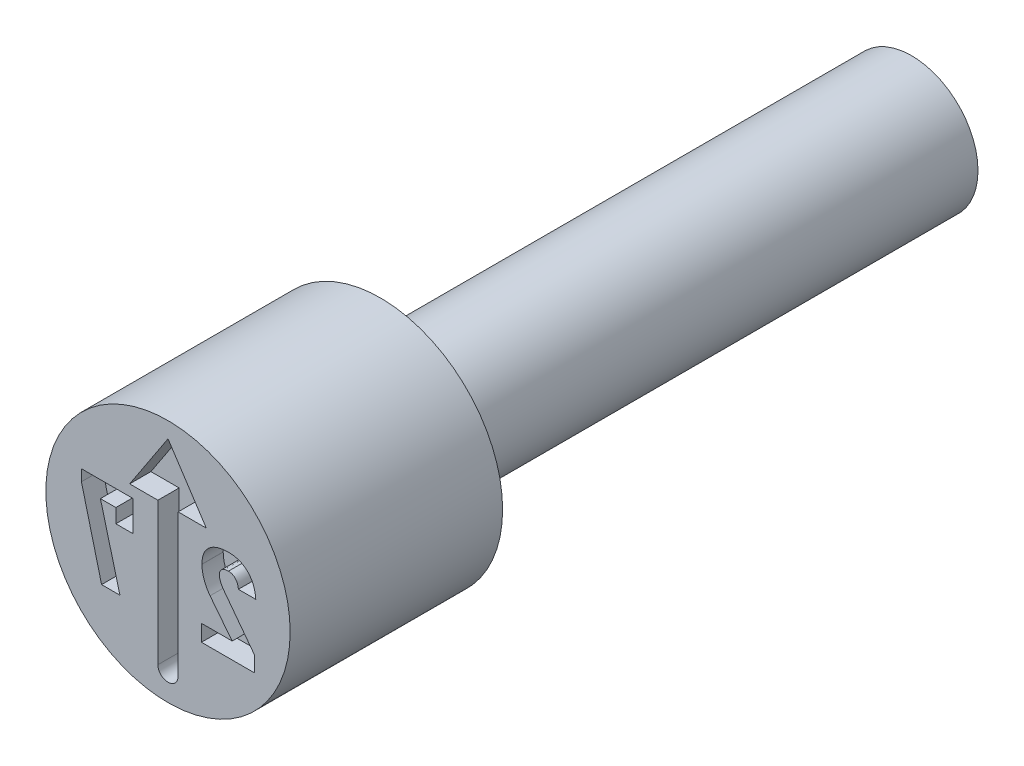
ISO-10303-21;
HEADER;
FILE_DESCRIPTION(('STEP AP214'),'2;1');
FILE_NAME('part.step','',(''),(''),'','','');
FILE_SCHEMA(('AUTOMOTIVE_DESIGN { 1 0 10303 214 1 1 1 1 }'));
ENDSEC;
DATA;
#1=APPLICATION_CONTEXT('core data for automotive mechanical design processes');
#2=APPLICATION_PROTOCOL_DEFINITION('international standard','automotive_design',2000,#1);
#3=PRODUCT_CONTEXT('',#1,'mechanical');
#4=PRODUCT('Part','Part','',(#3));
#5=PRODUCT_RELATED_PRODUCT_CATEGORY('part','',(#4));
#6=PRODUCT_DEFINITION_FORMATION('','',#4);
#7=PRODUCT_DEFINITION_CONTEXT('part definition',#1,'design');
#8=PRODUCT_DEFINITION('design','',#6,#7);
#9=PRODUCT_DEFINITION_SHAPE('','',#8);
#10=(LENGTH_UNIT() NAMED_UNIT(*) SI_UNIT(.MILLI.,.METRE.));
#11=(NAMED_UNIT(*) PLANE_ANGLE_UNIT() SI_UNIT($,.RADIAN.));
#12=(NAMED_UNIT(*) SI_UNIT($,.STERADIAN.) SOLID_ANGLE_UNIT());
#13=UNCERTAINTY_MEASURE_WITH_UNIT(LENGTH_MEASURE(1.E-05),#10,'distance_accuracy_value','');
#14=(GEOMETRIC_REPRESENTATION_CONTEXT(3) GLOBAL_UNCERTAINTY_ASSIGNED_CONTEXT((#13)) GLOBAL_UNIT_ASSIGNED_CONTEXT((#10,
#11,#12)) REPRESENTATION_CONTEXT('',''));
#15=CARTESIAN_POINT('',(0.,0.,0.));
#16=DIRECTION('',(0.,0.,1.));
#17=DIRECTION('',(1.,0.,0.));
#18=AXIS2_PLACEMENT_3D('',#15,#16,#17);
#19=CARTESIAN_POINT('',(0.,1.25,-4.));
#20=DIRECTION('',(0.,0.,1.));
#21=DIRECTION('',(1.,0.,0.));
#22=AXIS2_PLACEMENT_3D('',#19,#20,#21);
#23=PLANE('',#22);
#24=CARTESIAN_POINT('',(0.,0.,-4.));
#25=DIRECTION('',(0.,0.,1.));
#26=DIRECTION('',(1.,0.,0.));
#27=AXIS2_PLACEMENT_3D('',#24,#25,#26);
#28=CIRCLE('',#27,2.3);
#29=CARTESIAN_POINT('',(2.3,0.,-4.));
#30=VERTEX_POINT('',#29);
#31=EDGE_CURVE('E11',#30,#30,#28,.T.);
#32=ORIENTED_EDGE('',*,*,#31,.F.);
#33=EDGE_LOOP('',(#32));
#34=FACE_BOUND('',#33,.T.);
#35=CARTESIAN_POINT('',(0.,0.,-4.));
#36=DIRECTION('',(0.,0.,1.));
#37=DIRECTION('',(1.,0.,0.));
#38=AXIS2_PLACEMENT_3D('',#35,#36,#37);
#39=CIRCLE('',#38,1.25);
#40=CARTESIAN_POINT('',(1.25,0.,-4.));
#41=VERTEX_POINT('',#40);
#42=EDGE_CURVE('E430',#41,#41,#39,.T.);
#43=ORIENTED_EDGE('',*,*,#42,.T.);
#44=EDGE_LOOP('',(#43));
#45=FACE_BOUND('',#44,.T.);
#46=ADVANCED_FACE('F39',(#34,#45),#23,.F.);
#47=CARTESIAN_POINT('',(0.,0.,-0.403888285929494));
#48=DIRECTION('',(0.,0.,1.));
#49=DIRECTION('',(1.,0.,0.));
#50=AXIS2_PLACEMENT_3D('',#47,#48,#49);
#51=CYLINDRICAL_SURFACE('',#50,2.3);
#52=CARTESIAN_POINT('',(0.,0.,0.));
#53=DIRECTION('',(0.,0.,1.));
#54=DIRECTION('',(1.,0.,0.));
#55=AXIS2_PLACEMENT_3D('',#52,#53,#54);
#56=CIRCLE('',#55,2.3);
#57=CARTESIAN_POINT('',(2.3,0.,0.));
#58=VERTEX_POINT('',#57);
#59=EDGE_CURVE('E46',#58,#58,#56,.T.);
#60=ORIENTED_EDGE('',*,*,#59,.F.);
#61=EDGE_LOOP('',(#60));
#62=FACE_BOUND('',#61,.T.);
#63=ORIENTED_EDGE('',*,*,#31,.T.);
#64=EDGE_LOOP('',(#63));
#65=FACE_BOUND('',#64,.T.);
#66=ADVANCED_FACE('F415',(#62,#65),#51,.T.);
#67=CARTESIAN_POINT('',(0.,2.3,0.));
#68=DIRECTION('',(0.,0.,-1.));
#69=DIRECTION('',(-1.,0.,0.));
#70=AXIS2_PLACEMENT_3D('',#67,#68,#69);
#71=PLANE('',#70);
#72=DIRECTION('',(0.,-1.,0.));
#73=VECTOR('',#72,1.);
#74=CARTESIAN_POINT('',(-1.62996960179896,0.7,0.));
#75=LINE('',#74,#73);
#76=CARTESIAN_POINT('',(-1.62996960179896,0.7,0.));
#77=VERTEX_POINT('',#76);
#78=CARTESIAN_POINT('',(-1.62996960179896,0.486810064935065,0.));
#79=VERTEX_POINT('',#78);
#80=EDGE_CURVE('E297',#77,#79,#75,.T.);
#81=ORIENTED_EDGE('',*,*,#80,.F.);
#82=DIRECTION('',(-1.,0.,0.));
#83=VECTOR('',#82,1.);
#84=CARTESIAN_POINT('',(-0.662680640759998,0.7,0.));
#85=LINE('',#84,#83);
#86=CARTESIAN_POINT('',(-0.662680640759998,0.7,0.));
#87=VERTEX_POINT('',#86);
#88=EDGE_CURVE('E53',#87,#77,#85,.T.);
#89=ORIENTED_EDGE('',*,*,#88,.F.);
#90=DIRECTION('',(0.,1.,0.));
#91=VECTOR('',#90,1.);
#92=CARTESIAN_POINT('',(-0.662680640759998,0.125974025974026,0.));
#93=LINE('',#92,#91);
#94=CARTESIAN_POINT('',(-0.662680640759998,0.125974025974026,0.));
#95=VERTEX_POINT('',#94);
#96=EDGE_CURVE('E274',#95,#87,#93,.T.);
#97=ORIENTED_EDGE('',*,*,#96,.F.);
#98=DIRECTION('',(1.,0.,0.));
#99=VECTOR('',#98,1.);
#100=CARTESIAN_POINT('',(-0.981775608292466,0.125974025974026,0.));
#101=LINE('',#100,#99);
#102=CARTESIAN_POINT('',(-0.981775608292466,0.125974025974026,0.));
#103=VERTEX_POINT('',#102);
#104=EDGE_CURVE('E277',#103,#95,#101,.T.);
#105=ORIENTED_EDGE('',*,*,#104,.F.);
#106=DIRECTION('',(0.,-1.,0.));
#107=VECTOR('',#106,1.);
#108=CARTESIAN_POINT('',(-0.981775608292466,0.390909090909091,0.));
#109=LINE('',#108,#107);
#110=CARTESIAN_POINT('',(-0.981775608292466,0.390909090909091,0.));
#111=VERTEX_POINT('',#110);
#112=EDGE_CURVE('E311',#111,#103,#109,.T.);
#113=ORIENTED_EDGE('',*,*,#112,.F.);
#114=DIRECTION('',(1.,0.,0.));
#115=VECTOR('',#114,1.);
#116=CARTESIAN_POINT('',(-1.2725832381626,0.390909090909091,0.));
#117=LINE('',#116,#115);
#118=CARTESIAN_POINT('',(-1.2725832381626,0.390909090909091,0.));
#119=VERTEX_POINT('',#118);
#120=EDGE_CURVE('E308',#119,#111,#117,.T.);
#121=ORIENTED_EDGE('',*,*,#120,.F.);
#122=DIRECTION('',(-0.255602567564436,0.966781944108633,0.));
#123=VECTOR('',#122,1.);
#124=CARTESIAN_POINT('',(-0.904847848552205,-1.,0.));
#125=LINE('',#124,#123);
#126=CARTESIAN_POINT('',(-0.904847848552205,-1.,0.));
#127=VERTEX_POINT('',#126);
#128=EDGE_CURVE('E305',#127,#119,#125,.T.);
#129=ORIENTED_EDGE('',*,*,#128,.F.);
#130=DIRECTION('',(1.,0.,0.));
#131=VECTOR('',#130,1.);
#132=CARTESIAN_POINT('',(-1.25050531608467,-1.,0.));
#133=LINE('',#132,#131);
#134=CARTESIAN_POINT('',(-1.25050531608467,-1.,0.));
#135=VERTEX_POINT('',#134);
#136=EDGE_CURVE('E302',#135,#127,#133,.T.);
#137=ORIENTED_EDGE('',*,*,#136,.F.);
#138=DIRECTION('',(0.247293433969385,-0.968940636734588,0.));
#139=VECTOR('',#138,1.);
#140=CARTESIAN_POINT('',(-1.62996960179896,0.486810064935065,0.));
#141=LINE('',#140,#139);
#142=EDGE_CURVE('E299',#79,#135,#141,.T.);
#143=ORIENTED_EDGE('',*,*,#142,.F.);
#144=EDGE_LOOP('',(#81,#89,#97,#105,#113,#121,#129,#137,#143));
#145=FACE_BOUND('',#144,.T.);
#146=DIRECTION('',(0.,1.,0.));
#147=VECTOR('',#146,1.);
#148=CARTESIAN_POINT('',(1.63114646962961,-1.,0.));
#149=LINE('',#148,#147);
#150=CARTESIAN_POINT('',(1.63114646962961,-1.,0.));
#151=VERTEX_POINT('',#150);
#152=CARTESIAN_POINT('',(1.63114646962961,-0.710917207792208,0.));
#153=VERTEX_POINT('',#152);
#154=EDGE_CURVE('E602',#151,#153,#149,.T.);
#155=ORIENTED_EDGE('',*,*,#154,.F.);
#156=DIRECTION('',(1.,0.,0.));
#157=VECTOR('',#156,1.);
#158=CARTESIAN_POINT('',(0.630050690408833,-1.,0.));
#159=LINE('',#158,#157);
#160=CARTESIAN_POINT('',(0.630050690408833,-1.,0.));
#161=VERTEX_POINT('',#160);
#162=EDGE_CURVE('E61',#161,#151,#159,.T.);
#163=ORIENTED_EDGE('',*,*,#162,.F.);
#164=DIRECTION('',(0.,-1.,0.));
#165=VECTOR('',#164,1.);
#166=CARTESIAN_POINT('',(0.630050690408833,-0.690909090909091,0.));
#167=LINE('',#166,#165);
#168=CARTESIAN_POINT('',(0.630050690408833,-0.690909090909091,0.));
#169=VERTEX_POINT('',#168);
#170=EDGE_CURVE('E335',#169,#161,#167,.T.);
#171=ORIENTED_EDGE('',*,*,#170,.F.);
#172=DIRECTION('',(-1.,0.,0.));
#173=VECTOR('',#172,1.);
#174=CARTESIAN_POINT('',(1.20856124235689,-0.690909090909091,0.));
#175=LINE('',#174,#173);
#176=CARTESIAN_POINT('',(1.20856124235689,-0.690909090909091,0.));
#177=VERTEX_POINT('',#176);
#178=EDGE_CURVE('E530',#177,#169,#175,.T.);
#179=ORIENTED_EDGE('',*,*,#178,.F.);
#180=DIRECTION('',(0.618183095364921,-0.786034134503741,0.));
#181=VECTOR('',#180,1.);
#182=CARTESIAN_POINT('',(0.791840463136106,-0.161038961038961,0.));
#183=LINE('',#182,#181);
#184=CARTESIAN_POINT('',(0.791840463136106,-0.161038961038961,0.));
#185=VERTEX_POINT('',#184);
#186=EDGE_CURVE('E533',#185,#177,#183,.T.);
#187=ORIENTED_EDGE('',*,*,#186,.F.);
#188=CARTESIAN_POINT('',(0.639364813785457,0.27637987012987,0.));
#189=CARTESIAN_POINT('',(0.639804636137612,0.257037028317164,0.));
#190=CARTESIAN_POINT('',(0.640685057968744,0.218317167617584,0.));
#191=CARTESIAN_POINT('',(0.648632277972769,0.160367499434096,0.));
#192=CARTESIAN_POINT('',(0.661439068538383,0.102713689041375,0.));
#193=CARTESIAN_POINT('',(0.679027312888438,0.0456342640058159,0.));
#194=CARTESIAN_POINT('',(0.700876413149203,-0.00988207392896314,0.));
#195=CARTESIAN_POINT('',(0.727099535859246,-0.0630750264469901,0.));
#196=CARTESIAN_POINT('',(0.756695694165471,-0.113968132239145,0.));
#197=CARTESIAN_POINT('',(0.780147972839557,-0.145378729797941,0.));
#198=CARTESIAN_POINT('',(0.791840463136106,-0.161038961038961,0.));
#199=B_SPLINE_CURVE_WITH_KNOTS('',3,(#188,#189,#190,#191,#192,#193,#194,#195,#196,#197,#198),
.UNSPECIFIED.,.F.,.F.,(4,1,1,1,1,1,1,1,4),(0.,0.123046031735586,0.246309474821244,
0.371480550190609,0.498560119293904,0.626024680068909,0.750715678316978,0.875715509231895,1.),.UNSPECIFIED.);
#200=CARTESIAN_POINT('',(0.639364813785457,0.27637987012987,0.));
#201=VERTEX_POINT('',#200);
#202=EDGE_CURVE('E536',#201,#185,#199,.T.);
#203=ORIENTED_EDGE('',*,*,#202,.F.);
#204=DIRECTION('',(0.,-1.,0.));
#205=VECTOR('',#204,1.);
#206=CARTESIAN_POINT('',(0.639364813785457,0.27775974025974,0.));
#207=LINE('',#206,#205);
#208=CARTESIAN_POINT('',(0.639364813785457,0.27775974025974,0.));
#209=VERTEX_POINT('',#208);
#210=EDGE_CURVE('E541',#209,#201,#207,.T.);
#211=ORIENTED_EDGE('',*,*,#210,.F.);
#212=CARTESIAN_POINT('',(1.13991270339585,0.722077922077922,0.));
#213=CARTESIAN_POINT('',(1.12057893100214,0.721803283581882,0.));
#214=CARTESIAN_POINT('',(1.08297730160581,0.721269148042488,0.));
#215=CARTESIAN_POINT('',(1.02823583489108,0.715503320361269,0.));
#216=CARTESIAN_POINT('',(0.976729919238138,0.706801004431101,0.));
#217=CARTESIAN_POINT('',(0.928542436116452,0.694069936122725,0.));
#218=CARTESIAN_POINT('',(0.883866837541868,0.677463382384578,0.));
#219=CARTESIAN_POINT('',(0.842569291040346,0.657439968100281,0.));
#220=CARTESIAN_POINT('',(0.804563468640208,0.633829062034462,0.));
#221=CARTESIAN_POINT('',(0.770140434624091,0.606580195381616,0.));
#222=CARTESIAN_POINT('',(0.739168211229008,0.57618842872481,0.));
#223=CARTESIAN_POINT('',(0.712509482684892,0.542345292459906,0.));
#224=CARTESIAN_POINT('',(0.68943193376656,0.505734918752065,0.));
#225=CARTESIAN_POINT('',(0.671392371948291,0.465647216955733,0.));
#226=CARTESIAN_POINT('',(0.656540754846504,0.423024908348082,0.));
#227=CARTESIAN_POINT('',(0.646924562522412,0.377103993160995,0.));
#228=CARTESIAN_POINT('',(0.640444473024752,0.328425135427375,0.));
#229=CARTESIAN_POINT('',(0.639730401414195,0.294915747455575,0.));
#230=CARTESIAN_POINT('',(0.639364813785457,0.27775974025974,0.));
#231=B_SPLINE_CURVE_WITH_KNOTS('',3,(#212,#213,#214,#215,#216,#217,#218,#219,#220,#221,#222,
#223,#224,#225,#226,#227,#228,#229,#230),.UNSPECIFIED.,.F.,.F.,(4,1,1,1,1,1,1,1,1,1,1,1,1,1,1,1,
4),(0.,0.0762312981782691,0.148259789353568,0.216860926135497,0.28210063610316,
0.344528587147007,0.404571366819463,0.462840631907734,0.520642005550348,0.577409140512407,
0.633580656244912,0.690215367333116,0.747647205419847,0.806597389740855,0.867894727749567,
0.932365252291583,1.),.UNSPECIFIED.);
#232=CARTESIAN_POINT('',(1.13991270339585,0.722077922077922,0.));
#233=VERTEX_POINT('',#232);
#234=EDGE_CURVE('E547',#233,#209,#231,.T.);
#235=ORIENTED_EDGE('',*,*,#234,.F.);
#236=CARTESIAN_POINT('',(1.65218948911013,0.211870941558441,0.));
#237=CARTESIAN_POINT('',(1.65057580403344,0.231576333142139,0.));
#238=CARTESIAN_POINT('',(1.64742592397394,0.270040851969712,0.));
#239=CARTESIAN_POINT('',(1.63709924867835,0.32568153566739,0.));
#240=CARTESIAN_POINT('',(1.62375242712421,0.378091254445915,0.));
#241=CARTESIAN_POINT('',(1.60677347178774,0.427259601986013,0.));
#242=CARTESIAN_POINT('',(1.58495545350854,0.472617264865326,0.));
#243=CARTESIAN_POINT('',(1.56044224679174,0.5151124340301,0.));
#244=CARTESIAN_POINT('',(1.53095900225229,0.553430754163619,0.));
#245=CARTESIAN_POINT('',(1.49868545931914,0.588854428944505,0.));
#246=CARTESIAN_POINT('',(1.46273850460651,0.62005508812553,0.));
#247=CARTESIAN_POINT('',(1.42440917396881,0.647578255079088,0.));
#248=CARTESIAN_POINT('',(1.38311786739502,0.670481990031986,0.));
#249=CARTESIAN_POINT('',(1.33949232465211,0.68948199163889,0.));
#250=CARTESIAN_POINT('',(1.29304886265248,0.703902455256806,0.));
#251=CARTESIAN_POINT('',(1.24439414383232,0.714704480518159,0.));
#252=CARTESIAN_POINT('',(1.1929697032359,0.720934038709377,0.));
#253=CARTESIAN_POINT('',(1.15786767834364,0.721690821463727,0.));
#254=CARTESIAN_POINT('',(1.13991270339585,0.722077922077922,0.));
#255=B_SPLINE_CURVE_WITH_KNOTS('',3,(#236,#237,#238,#239,#240,#241,#242,#243,#244,#245,#246,
#247,#248,#249,#250,#251,#252,#253,#254),.UNSPECIFIED.,.F.,.F.,(4,1,1,1,1,1,1,1,1,1,1,1,1,1,1,1,
4),(0.,0.0733268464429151,0.14313249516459,0.209679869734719,0.273918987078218,0.33576228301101,
0.396210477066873,0.45560885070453,0.514796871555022,0.573764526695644,0.631900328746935,
0.689592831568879,0.748648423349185,0.808163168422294,0.86976604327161,0.933384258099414,1.),.UNSPECIFIED.);
#256=CARTESIAN_POINT('',(1.65218948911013,0.211870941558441,0.));
#257=VERTEX_POINT('',#256);
#258=EDGE_CURVE('E552',#257,#233,#255,.T.);
#259=ORIENTED_EDGE('',*,*,#258,.F.);
#260=DIRECTION('',(0.,1.,0.));
#261=VECTOR('',#260,1.);
#262=CARTESIAN_POINT('',(1.65218948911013,0.210836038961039,0.));
#263=LINE('',#262,#261);
#264=CARTESIAN_POINT('',(1.65218948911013,0.210836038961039,0.));
#265=VERTEX_POINT('',#264);
#266=EDGE_CURVE('E560',#265,#257,#263,.T.);
#267=ORIENTED_EDGE('',*,*,#266,.F.);
#268=DIRECTION('',(1.,0.,0.));
#269=VECTOR('',#268,1.);
#270=CARTESIAN_POINT('',(1.32516026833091,0.210836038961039,0.));
#271=LINE('',#270,#269);
#272=CARTESIAN_POINT('',(1.32516026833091,0.210836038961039,0.));
#273=VERTEX_POINT('',#272);
#274=EDGE_CURVE('E566',#273,#265,#271,.T.);
#275=ORIENTED_EDGE('',*,*,#274,.F.);
#276=DIRECTION('',(0.,-1.,0.));
#277=VECTOR('',#276,1.);
#278=CARTESIAN_POINT('',(1.32516026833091,0.211870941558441,0.));
#279=LINE('',#278,#277);
#280=CARTESIAN_POINT('',(1.32516026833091,0.211870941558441,0.));
#281=VERTEX_POINT('',#280);
#282=EDGE_CURVE('E569',#281,#273,#279,.T.);
#283=ORIENTED_EDGE('',*,*,#282,.F.);
#284=CARTESIAN_POINT('',(1.13749793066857,0.412987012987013,0.));
#285=CARTESIAN_POINT('',(1.14999542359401,0.412499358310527,0.));
#286=CARTESIAN_POINT('',(1.1742784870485,0.411551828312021,0.));
#287=CARTESIAN_POINT('',(1.20865530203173,0.401050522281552,0.));
#288=CARTESIAN_POINT('',(1.23963216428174,0.384578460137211,0.));
#289=CARTESIAN_POINT('',(1.26633668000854,0.361074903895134,0.));
#290=CARTESIAN_POINT('',(1.2884500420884,0.331565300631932,0.));
#291=CARTESIAN_POINT('',(1.30639717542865,0.296815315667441,0.));
#292=CARTESIAN_POINT('',(1.31858673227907,0.256197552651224,0.));
#293=CARTESIAN_POINT('',(1.32289858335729,0.227121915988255,0.));
#294=CARTESIAN_POINT('',(1.32516026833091,0.211870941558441,0.));
#295=B_SPLINE_CURVE_WITH_KNOTS('',3,(#284,#285,#286,#287,#288,#289,#290,#291,#292,#293,#294),
.UNSPECIFIED.,.F.,.F.,(4,1,1,1,1,1,1,1,4),(0.,0.122603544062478,0.238222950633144,
0.350089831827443,0.46555970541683,0.58502806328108,0.711014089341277,0.848418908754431,1.),.UNSPECIFIED.);
#296=CARTESIAN_POINT('',(1.13749793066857,0.412987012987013,0.));
#297=VERTEX_POINT('',#296);
#298=EDGE_CURVE('E572',#297,#281,#295,.T.);
#299=ORIENTED_EDGE('',*,*,#298,.F.);
#300=CARTESIAN_POINT('',(0.967773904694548,0.268790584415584,0.));
#301=CARTESIAN_POINT('',(0.968245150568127,0.279660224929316,0.));
#302=CARTESIAN_POINT('',(0.96914798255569,0.30048472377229,0.));
#303=CARTESIAN_POINT('',(0.977654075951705,0.329826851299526,0.));
#304=CARTESIAN_POINT('',(0.991595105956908,0.355379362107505,0.));
#305=CARTESIAN_POINT('',(1.01156202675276,0.37648565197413,0.));
#306=CARTESIAN_POINT('',(1.03641931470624,0.393179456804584,0.));
#307=CARTESIAN_POINT('',(1.06616174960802,0.404944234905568,0.));
#308=CARTESIAN_POINT('',(1.10040017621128,0.411690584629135,0.));
#309=CARTESIAN_POINT('',(1.12470248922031,0.412539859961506,0.));
#310=CARTESIAN_POINT('',(1.13749793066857,0.412987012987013,0.));
#311=B_SPLINE_CURVE_WITH_KNOTS('',3,(#300,#301,#302,#303,#304,#305,#306,#307,#308,#309,#310),
.UNSPECIFIED.,.F.,.F.,(4,1,1,1,1,1,1,1,4),(0.,0.128749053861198,0.246662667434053,
0.359069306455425,0.471077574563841,0.588039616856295,0.711712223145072,0.848213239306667,1.),.UNSPECIFIED.);
#312=CARTESIAN_POINT('',(0.967773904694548,0.268790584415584,0.));
#313=VERTEX_POINT('',#312);
#314=EDGE_CURVE('E577',#313,#297,#311,.T.);
#315=ORIENTED_EDGE('',*,*,#314,.F.);
#316=DIRECTION('',(0.,1.,0.));
#317=VECTOR('',#316,1.);
#318=CARTESIAN_POINT('',(0.967773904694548,0.266375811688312,0.));
#319=LINE('',#318,#317);
#320=CARTESIAN_POINT('',(0.967773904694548,0.266375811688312,0.));
#321=VERTEX_POINT('',#320);
#322=EDGE_CURVE('E585',#321,#313,#319,.T.);
#323=ORIENTED_EDGE('',*,*,#322,.F.);
#324=CARTESIAN_POINT('',(1.05022114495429,0.058705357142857,0.));
#325=CARTESIAN_POINT('',(1.0380535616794,0.0758501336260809,0.));
#326=CARTESIAN_POINT('',(1.01434539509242,0.10925621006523,0.));
#327=CARTESIAN_POINT('',(0.992887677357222,0.155132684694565,0.));
#328=CARTESIAN_POINT('',(0.97952040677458,0.191100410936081,0.));
#329=CARTESIAN_POINT('',(0.9731498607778,0.217184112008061,0.));
#330=CARTESIAN_POINT('',(0.968605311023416,0.242070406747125,0.));
#331=CARTESIAN_POINT('',(0.968045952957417,0.258422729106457,0.));
#332=CARTESIAN_POINT('',(0.967773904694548,0.266375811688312,0.));
#333=B_SPLINE_CURVE_WITH_KNOTS('',3,(#324,#325,#326,#327,#328,#329,#330,#331,#332),
.UNSPECIFIED.,.F.,.F.,(4,1,1,1,1,1,4),(0.,0.277375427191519,0.54045759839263,0.666416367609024,
0.784009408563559,0.894951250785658,1.),.UNSPECIFIED.);
#334=CARTESIAN_POINT('',(1.05022114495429,0.058705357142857,0.));
#335=VERTEX_POINT('',#334);
#336=EDGE_CURVE('E591',#335,#321,#333,.T.);
#337=ORIENTED_EDGE('',*,*,#336,.F.);
#338=DIRECTION('',(-0.602458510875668,0.798150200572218,0.));
#339=VECTOR('',#338,1.);
#340=CARTESIAN_POINT('',(1.63114646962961,-0.710917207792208,0.));
#341=LINE('',#340,#339);
#342=EDGE_CURVE('E596',#153,#335,#341,.T.);
#343=ORIENTED_EDGE('',*,*,#342,.F.);
#344=EDGE_LOOP('',(#155,#163,#171,#179,#187,#203,#211,#235,#259,#267,#275,#283,#299,#315,#323,
#337,#343));
#345=FACE_BOUND('',#344,.T.);
#346=DIRECTION('',(0.,1.,0.));
#347=VECTOR('',#346,1.);
#348=CARTESIAN_POINT('',(0.190473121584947,0.906351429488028,0.));
#349=LINE('',#348,#347);
#350=CARTESIAN_POINT('',(0.190473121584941,-1.77616183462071,0.));
#351=VERTEX_POINT('',#350);
#352=CARTESIAN_POINT('',(0.190473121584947,0.906351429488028,0.));
#353=VERTEX_POINT('',#352);
#354=EDGE_CURVE('E469',#351,#353,#349,.T.);
#355=ORIENTED_EDGE('',*,*,#354,.F.);
#356=CARTESIAN_POINT('',(1.6342449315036E-13,-1.77616183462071,0.));
#357=DIRECTION('',(0.,0.,1.));
#358=DIRECTION('',(1.,0.,0.));
#359=AXIS2_PLACEMENT_3D('',#356,#357,#358);
#360=CIRCLE('',#359,0.190473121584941);
#361=CARTESIAN_POINT('',(-0.190473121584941,-1.77616183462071,0.));
#362=VERTEX_POINT('',#361);
#363=EDGE_CURVE('E472',#362,#351,#360,.T.);
#364=ORIENTED_EDGE('',*,*,#363,.F.);
#365=DIRECTION('',(0.,-1.,0.));
#366=VECTOR('',#365,1.);
#367=CARTESIAN_POINT('',(-0.190473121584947,0.906351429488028,0.));
#368=LINE('',#367,#366);
#369=CARTESIAN_POINT('',(-0.190473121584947,0.906351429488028,0.));
#370=VERTEX_POINT('',#369);
#371=EDGE_CURVE('E453',#370,#362,#368,.T.);
#372=ORIENTED_EDGE('',*,*,#371,.F.);
#373=DIRECTION('',(1.,0.,0.));
#374=VECTOR('',#373,1.);
#375=CARTESIAN_POINT('',(-0.721917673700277,0.906351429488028,0.));
#376=LINE('',#375,#374);
#377=CARTESIAN_POINT('',(-0.721917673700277,0.906351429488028,0.));
#378=VERTEX_POINT('',#377);
#379=EDGE_CURVE('E457',#378,#370,#376,.T.);
#380=ORIENTED_EDGE('',*,*,#379,.F.);
#381=DIRECTION('',(-0.550159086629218,-0.835059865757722,0.));
#382=VECTOR('',#381,1.);
#383=CARTESIAN_POINT('',(0.,2.00211534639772,0.));
#384=LINE('',#383,#382);
#385=CARTESIAN_POINT('',(0.,2.00211534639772,0.));
#386=VERTEX_POINT('',#385);
#387=EDGE_CURVE('E460',#386,#378,#384,.T.);
#388=ORIENTED_EDGE('',*,*,#387,.F.);
#389=DIRECTION('',(-0.550159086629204,0.835059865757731,0.));
#390=VECTOR('',#389,1.);
#391=CARTESIAN_POINT('',(0.,2.00211534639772,0.));
#392=LINE('',#391,#390);
#393=CARTESIAN_POINT('',(0.721917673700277,0.906351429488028,0.));
#394=VERTEX_POINT('',#393);
#395=EDGE_CURVE('E463',#394,#386,#392,.T.);
#396=ORIENTED_EDGE('',*,*,#395,.F.);
#397=DIRECTION('',(1.,0.,0.));
#398=VECTOR('',#397,1.);
#399=CARTESIAN_POINT('',(0.721917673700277,0.906351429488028,0.));
#400=LINE('',#399,#398);
#401=EDGE_CURVE('E466',#353,#394,#400,.T.);
#402=ORIENTED_EDGE('',*,*,#401,.F.);
#403=EDGE_LOOP('',(#355,#364,#372,#380,#388,#396,#402));
#404=FACE_BOUND('',#403,.T.);
#405=ORIENTED_EDGE('',*,*,#59,.T.);
#406=EDGE_LOOP('',(#405));
#407=FACE_BOUND('',#406,.T.);
#408=ADVANCED_FACE('F412',(#145,#345,#404,#407),#71,.F.);
#409=CARTESIAN_POINT('',(0.,0.,-14.));
#410=DIRECTION('',(0.,0.,1.));
#411=DIRECTION('',(1.,0.,0.));
#412=AXIS2_PLACEMENT_3D('',#409,#410,#411);
#413=PLANE('',#412);
#414=CARTESIAN_POINT('',(0.,0.,-14.));
#415=DIRECTION('',(0.,0.,1.));
#416=DIRECTION('',(1.,0.,0.));
#417=AXIS2_PLACEMENT_3D('',#414,#415,#416);
#418=CIRCLE('',#417,1.25);
#419=CARTESIAN_POINT('',(1.25,0.,-14.));
#420=VERTEX_POINT('',#419);
#421=EDGE_CURVE('E431',#420,#420,#418,.T.);
#422=ORIENTED_EDGE('',*,*,#421,.F.);
#423=EDGE_LOOP('',(#422));
#424=FACE_BOUND('',#423,.T.);
#425=ADVANCED_FACE('F408',(#424),#413,.F.);
#426=CARTESIAN_POINT('',(0.,0.,-0.403888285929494));
#427=DIRECTION('',(0.,0.,1.));
#428=DIRECTION('',(1.,0.,0.));
#429=AXIS2_PLACEMENT_3D('',#426,#427,#428);
#430=CYLINDRICAL_SURFACE('',#429,1.25);
#431=ORIENTED_EDGE('',*,*,#42,.F.);
#432=EDGE_LOOP('',(#431));
#433=FACE_BOUND('',#432,.T.);
#434=ORIENTED_EDGE('',*,*,#421,.T.);
#435=EDGE_LOOP('',(#434));
#436=FACE_BOUND('',#435,.T.);
#437=ADVANCED_FACE('F404',(#433,#436),#430,.T.);
#438=CARTESIAN_POINT('',(1.6342449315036E-13,-1.77616183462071,-0.4));
#439=DIRECTION('',(0.,0.,1.));
#440=DIRECTION('',(1.,0.,0.));
#441=AXIS2_PLACEMENT_3D('',#438,#439,#440);
#442=CYLINDRICAL_SURFACE('',#441,0.190473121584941);
#443=ORIENTED_EDGE('',*,*,#363,.T.);
#444=DIRECTION('',(0.,0.,1.));
#445=VECTOR('',#444,1.);
#446=CARTESIAN_POINT('',(0.190473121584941,-1.77616183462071,-0.4));
#447=LINE('',#446,#445);
#448=CARTESIAN_POINT('',(0.190473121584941,-1.77616183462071,-0.4));
#449=VERTEX_POINT('',#448);
#450=EDGE_CURVE('E439',#449,#351,#447,.T.);
#451=ORIENTED_EDGE('',*,*,#450,.F.);
#452=CARTESIAN_POINT('',(1.6342449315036E-13,-1.77616183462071,-0.4));
#453=DIRECTION('',(0.,0.,1.));
#454=DIRECTION('',(1.,0.,0.));
#455=AXIS2_PLACEMENT_3D('',#452,#453,#454);
#456=CIRCLE('',#455,0.190473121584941);
#457=CARTESIAN_POINT('',(-0.190473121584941,-1.77616183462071,-0.4));
#458=VERTEX_POINT('',#457);
#459=EDGE_CURVE('E456',#458,#449,#456,.T.);
#460=ORIENTED_EDGE('',*,*,#459,.F.);
#461=DIRECTION('',(0.,0.,1.));
#462=VECTOR('',#461,1.);
#463=CARTESIAN_POINT('',(-0.190473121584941,-1.77616183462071,-0.4));
#464=LINE('',#463,#462);
#465=EDGE_CURVE('E432',#458,#362,#464,.T.);
#466=ORIENTED_EDGE('',*,*,#465,.T.);
#467=EDGE_LOOP('',(#443,#451,#460,#466));
#468=FACE_BOUND('',#467,.T.);
#469=ADVANCED_FACE('F382',(#468),#442,.F.);
#470=CARTESIAN_POINT('',(-0.190473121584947,0.906351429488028,-0.4));
#471=DIRECTION('',(-1.,0.,0.));
#472=DIRECTION('',(0.,-1.,0.));
#473=AXIS2_PLACEMENT_3D('',#470,#471,#472);
#474=PLANE('',#473);
#475=ORIENTED_EDGE('',*,*,#371,.T.);
#476=ORIENTED_EDGE('',*,*,#465,.F.);
#477=DIRECTION('',(0.,-1.,0.));
#478=VECTOR('',#477,1.);
#479=CARTESIAN_POINT('',(-0.190473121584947,0.906351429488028,-0.4));
#480=LINE('',#479,#478);
#481=CARTESIAN_POINT('',(-0.190473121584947,0.906351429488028,-0.4));
#482=VERTEX_POINT('',#481);
#483=EDGE_CURVE('E444',#482,#458,#480,.T.);
#484=ORIENTED_EDGE('',*,*,#483,.F.);
#485=DIRECTION('',(0.,0.,1.));
#486=VECTOR('',#485,1.);
#487=CARTESIAN_POINT('',(-0.190473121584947,0.906351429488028,-0.4));
#488=LINE('',#487,#486);
#489=EDGE_CURVE('E436',#482,#370,#488,.T.);
#490=ORIENTED_EDGE('',*,*,#489,.T.);
#491=EDGE_LOOP('',(#475,#476,#484,#490));
#492=FACE_BOUND('',#491,.T.);
#493=ADVANCED_FACE('F378',(#492),#474,.F.);
#494=CARTESIAN_POINT('',(-0.721917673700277,0.906351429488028,-0.4));
#495=DIRECTION('',(0.,-1.,0.));
#496=DIRECTION('',(0.,0.,-1.));
#497=AXIS2_PLACEMENT_3D('',#494,#495,#496);
#498=PLANE('',#497);
#499=ORIENTED_EDGE('',*,*,#379,.T.);
#500=ORIENTED_EDGE('',*,*,#489,.F.);
#501=DIRECTION('',(1.,0.,0.));
#502=VECTOR('',#501,1.);
#503=CARTESIAN_POINT('',(-0.721917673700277,0.906351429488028,-0.4));
#504=LINE('',#503,#502);
#505=CARTESIAN_POINT('',(-0.721917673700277,0.906351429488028,-0.4));
#506=VERTEX_POINT('',#505);
#507=EDGE_CURVE('E477',#506,#482,#504,.T.);
#508=ORIENTED_EDGE('',*,*,#507,.F.);
#509=DIRECTION('',(0.,0.,1.));
#510=VECTOR('',#509,1.);
#511=CARTESIAN_POINT('',(-0.721917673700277,0.906351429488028,-0.4));
#512=LINE('',#511,#510);
#513=EDGE_CURVE('E450',#506,#378,#512,.T.);
#514=ORIENTED_EDGE('',*,*,#513,.T.);
#515=EDGE_LOOP('',(#499,#500,#508,#514));
#516=FACE_BOUND('',#515,.T.);
#517=ADVANCED_FACE('F381',(#516),#498,.F.);
#518=CARTESIAN_POINT('',(0.,2.00211534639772,-0.4));
#519=DIRECTION('',(-0.835059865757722,0.550159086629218,0.));
#520=DIRECTION('',(-0.550159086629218,-0.835059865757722,0.));
#521=AXIS2_PLACEMENT_3D('',#518,#519,#520);
#522=PLANE('',#521);
#523=ORIENTED_EDGE('',*,*,#387,.T.);
#524=ORIENTED_EDGE('',*,*,#513,.F.);
#525=DIRECTION('',(-0.550159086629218,-0.835059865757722,0.));
#526=VECTOR('',#525,1.);
#527=CARTESIAN_POINT('',(0.,2.00211534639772,-0.4));
#528=LINE('',#527,#526);
#529=CARTESIAN_POINT('',(0.,2.00211534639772,-0.4));
#530=VERTEX_POINT('',#529);
#531=EDGE_CURVE('E480',#530,#506,#528,.T.);
#532=ORIENTED_EDGE('',*,*,#531,.F.);
#533=DIRECTION('',(0.,0.,1.));
#534=VECTOR('',#533,1.);
#535=CARTESIAN_POINT('',(0.,2.00211534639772,-0.4));
#536=LINE('',#535,#534);
#537=EDGE_CURVE('E448',#530,#386,#536,.T.);
#538=ORIENTED_EDGE('',*,*,#537,.T.);
#539=EDGE_LOOP('',(#523,#524,#532,#538));
#540=FACE_BOUND('',#539,.T.);
#541=ADVANCED_FACE('F386',(#540),#522,.F.);
#542=CARTESIAN_POINT('',(0.,2.00211534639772,-0.4));
#543=DIRECTION('',(0.835059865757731,0.550159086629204,0.));
#544=DIRECTION('',(-0.550159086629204,0.835059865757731,0.));
#545=AXIS2_PLACEMENT_3D('',#542,#543,#544);
#546=PLANE('',#545);
#547=ORIENTED_EDGE('',*,*,#395,.T.);
#548=ORIENTED_EDGE('',*,*,#537,.F.);
#549=DIRECTION('',(-0.550159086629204,0.835059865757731,0.));
#550=VECTOR('',#549,1.);
#551=CARTESIAN_POINT('',(0.,2.00211534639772,-0.4));
#552=LINE('',#551,#550);
#553=CARTESIAN_POINT('',(0.721917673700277,0.906351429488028,-0.4));
#554=VERTEX_POINT('',#553);
#555=EDGE_CURVE('E483',#554,#530,#552,.T.);
#556=ORIENTED_EDGE('',*,*,#555,.F.);
#557=DIRECTION('',(0.,0.,1.));
#558=VECTOR('',#557,1.);
#559=CARTESIAN_POINT('',(0.721917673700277,0.906351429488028,-0.4));
#560=LINE('',#559,#558);
#561=EDGE_CURVE('E446',#554,#394,#560,.T.);
#562=ORIENTED_EDGE('',*,*,#561,.T.);
#563=EDGE_LOOP('',(#547,#548,#556,#562));
#564=FACE_BOUND('',#563,.T.);
#565=ADVANCED_FACE('F390',(#564),#546,.F.);
#566=CARTESIAN_POINT('',(0.721917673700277,0.906351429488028,-0.4));
#567=DIRECTION('',(0.,-1.,0.));
#568=DIRECTION('',(0.,0.,-1.));
#569=AXIS2_PLACEMENT_3D('',#566,#567,#568);
#570=PLANE('',#569);
#571=ORIENTED_EDGE('',*,*,#401,.T.);
#572=ORIENTED_EDGE('',*,*,#561,.F.);
#573=DIRECTION('',(1.,0.,0.));
#574=VECTOR('',#573,1.);
#575=CARTESIAN_POINT('',(0.721917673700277,0.906351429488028,-0.4));
#576=LINE('',#575,#574);
#577=CARTESIAN_POINT('',(0.190473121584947,0.906351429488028,-0.4));
#578=VERTEX_POINT('',#577);
#579=EDGE_CURVE('E486',#578,#554,#576,.T.);
#580=ORIENTED_EDGE('',*,*,#579,.F.);
#581=DIRECTION('',(0.,0.,1.));
#582=VECTOR('',#581,1.);
#583=CARTESIAN_POINT('',(0.190473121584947,0.906351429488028,-0.4));
#584=LINE('',#583,#582);
#585=EDGE_CURVE('E443',#578,#353,#584,.T.);
#586=ORIENTED_EDGE('',*,*,#585,.T.);
#587=EDGE_LOOP('',(#571,#572,#580,#586));
#588=FACE_BOUND('',#587,.T.);
#589=ADVANCED_FACE('F394',(#588),#570,.F.);
#590=CARTESIAN_POINT('',(0.190473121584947,0.906351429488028,-0.4));
#591=DIRECTION('',(1.,0.,0.));
#592=DIRECTION('',(0.,1.,0.));
#593=AXIS2_PLACEMENT_3D('',#590,#591,#592);
#594=PLANE('',#593);
#595=ORIENTED_EDGE('',*,*,#354,.T.);
#596=ORIENTED_EDGE('',*,*,#585,.F.);
#597=DIRECTION('',(0.,1.,0.));
#598=VECTOR('',#597,1.);
#599=CARTESIAN_POINT('',(0.190473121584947,0.906351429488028,-0.4));
#600=LINE('',#599,#598);
#601=EDGE_CURVE('E489',#449,#578,#600,.T.);
#602=ORIENTED_EDGE('',*,*,#601,.F.);
#603=ORIENTED_EDGE('',*,*,#450,.T.);
#604=EDGE_LOOP('',(#595,#596,#602,#603));
#605=FACE_BOUND('',#604,.T.);
#606=ADVANCED_FACE('F376',(#605),#594,.F.);
#607=CARTESIAN_POINT('',(1.6342449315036E-13,-1.77616183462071,-0.4));
#608=DIRECTION('',(0.,0.,1.));
#609=DIRECTION('',(1.,0.,0.));
#610=AXIS2_PLACEMENT_3D('',#607,#608,#609);
#611=PLANE('',#610);
#612=ORIENTED_EDGE('',*,*,#459,.T.);
#613=ORIENTED_EDGE('',*,*,#601,.T.);
#614=ORIENTED_EDGE('',*,*,#579,.T.);
#615=ORIENTED_EDGE('',*,*,#555,.T.);
#616=ORIENTED_EDGE('',*,*,#531,.T.);
#617=ORIENTED_EDGE('',*,*,#507,.T.);
#618=ORIENTED_EDGE('',*,*,#483,.T.);
#619=EDGE_LOOP('',(#612,#613,#614,#615,#616,#617,#618));
#620=FACE_BOUND('',#619,.T.);
#621=ADVANCED_FACE('F373',(#620),#611,.T.);
#622=CARTESIAN_POINT('',(0.630050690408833,-1.,-0.4));
#623=DIRECTION('',(0.,-1.,0.));
#624=DIRECTION('',(0.,0.,-1.));
#625=AXIS2_PLACEMENT_3D('',#622,#623,#624);
#626=PLANE('',#625);
#627=ORIENTED_EDGE('',*,*,#162,.T.);
#628=DIRECTION('',(0.,0.,1.));
#629=VECTOR('',#628,1.);
#630=CARTESIAN_POINT('',(1.63114646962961,-1.,-0.4));
#631=LINE('',#630,#629);
#632=CARTESIAN_POINT('',(1.63114646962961,-1.,-0.4));
#633=VERTEX_POINT('',#632);
#634=EDGE_CURVE('E494',#633,#151,#631,.T.);
#635=ORIENTED_EDGE('',*,*,#634,.F.);
#636=DIRECTION('',(1.,0.,0.));
#637=VECTOR('',#636,1.);
#638=CARTESIAN_POINT('',(0.630050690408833,-1.,-0.4));
#639=LINE('',#638,#637);
#640=CARTESIAN_POINT('',(0.630050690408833,-1.,-0.4));
#641=VERTEX_POINT('',#640);
#642=EDGE_CURVE('E331',#641,#633,#639,.T.);
#643=ORIENTED_EDGE('',*,*,#642,.F.);
#644=DIRECTION('',(0.,0.,1.));
#645=VECTOR('',#644,1.);
#646=CARTESIAN_POINT('',(0.630050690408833,-1.,-0.4));
#647=LINE('',#646,#645);
#648=EDGE_CURVE('E474',#641,#161,#647,.T.);
#649=ORIENTED_EDGE('',*,*,#648,.T.);
#650=EDGE_LOOP('',(#627,#635,#643,#649));
#651=FACE_BOUND('',#650,.T.);
#652=ADVANCED_FACE('F369',(#651),#626,.F.);
#653=CARTESIAN_POINT('',(0.630050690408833,-0.690909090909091,-0.4));
#654=DIRECTION('',(-1.,0.,0.));
#655=DIRECTION('',(0.,0.,1.));
#656=AXIS2_PLACEMENT_3D('',#653,#654,#655);
#657=PLANE('',#656);
#658=ORIENTED_EDGE('',*,*,#170,.T.);
#659=ORIENTED_EDGE('',*,*,#648,.F.);
#660=DIRECTION('',(0.,-1.,0.));
#661=VECTOR('',#660,1.);
#662=CARTESIAN_POINT('',(0.630050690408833,-0.690909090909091,-0.4));
#663=LINE('',#662,#661);
#664=CARTESIAN_POINT('',(0.630050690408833,-0.690909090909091,-0.4));
#665=VERTEX_POINT('',#664);
#666=EDGE_CURVE('E497',#665,#641,#663,.T.);
#667=ORIENTED_EDGE('',*,*,#666,.F.);
#668=DIRECTION('',(0.,0.,1.));
#669=VECTOR('',#668,1.);
#670=CARTESIAN_POINT('',(0.630050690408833,-0.690909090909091,-0.4));
#671=LINE('',#670,#669);
#672=EDGE_CURVE('E525',#665,#169,#671,.T.);
#673=ORIENTED_EDGE('',*,*,#672,.T.);
#674=EDGE_LOOP('',(#658,#659,#667,#673));
#675=FACE_BOUND('',#674,.T.);
#676=ADVANCED_FACE('F372',(#675),#657,.F.);
#677=CARTESIAN_POINT('',(1.20856124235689,-0.690909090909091,-0.4));
#678=DIRECTION('',(0.,1.,0.));
#679=DIRECTION('',(0.,0.,1.));
#680=AXIS2_PLACEMENT_3D('',#677,#678,#679);
#681=PLANE('',#680);
#682=ORIENTED_EDGE('',*,*,#178,.T.);
#683=ORIENTED_EDGE('',*,*,#672,.F.);
#684=DIRECTION('',(-1.,0.,0.));
#685=VECTOR('',#684,1.);
#686=CARTESIAN_POINT('',(1.20856124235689,-0.690909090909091,-0.4));
#687=LINE('',#686,#685);
#688=CARTESIAN_POINT('',(1.20856124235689,-0.690909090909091,-0.4));
#689=VERTEX_POINT('',#688);
#690=EDGE_CURVE('E608',#689,#665,#687,.T.);
#691=ORIENTED_EDGE('',*,*,#690,.F.);
#692=DIRECTION('',(0.,0.,1.));
#693=VECTOR('',#692,1.);
#694=CARTESIAN_POINT('',(1.20856124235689,-0.690909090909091,-0.4));
#695=LINE('',#694,#693);
#696=EDGE_CURVE('E523',#689,#177,#695,.T.);
#697=ORIENTED_EDGE('',*,*,#696,.T.);
#698=EDGE_LOOP('',(#682,#683,#691,#697));
#699=FACE_BOUND('',#698,.T.);
#700=ADVANCED_FACE('F724',(#699),#681,.F.);
#701=CARTESIAN_POINT('',(0.791840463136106,-0.161038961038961,-0.4));
#702=DIRECTION('',(-0.786034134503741,-0.618183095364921,0.));
#703=DIRECTION('',(0.618183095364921,-0.786034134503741,0.));
#704=AXIS2_PLACEMENT_3D('',#701,#702,#703);
#705=PLANE('',#704);
#706=ORIENTED_EDGE('',*,*,#186,.T.);
#707=ORIENTED_EDGE('',*,*,#696,.F.);
#708=DIRECTION('',(0.618183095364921,-0.786034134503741,0.));
#709=VECTOR('',#708,1.);
#710=CARTESIAN_POINT('',(0.791840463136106,-0.161038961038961,-0.4));
#711=LINE('',#710,#709);
#712=CARTESIAN_POINT('',(0.791840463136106,-0.161038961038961,-0.4));
#713=VERTEX_POINT('',#712);
#714=EDGE_CURVE('E611',#713,#689,#711,.T.);
#715=ORIENTED_EDGE('',*,*,#714,.F.);
#716=DIRECTION('',(0.,0.,1.));
#717=VECTOR('',#716,1.);
#718=CARTESIAN_POINT('',(0.791840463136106,-0.161038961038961,-0.4));
#719=LINE('',#718,#717);
#720=EDGE_CURVE('E521',#713,#185,#719,.T.);
#721=ORIENTED_EDGE('',*,*,#720,.T.);
#722=EDGE_LOOP('',(#706,#707,#715,#721));
#723=FACE_BOUND('',#722,.T.);
#724=ADVANCED_FACE('F631',(#723),#705,.F.);
#725=CARTESIAN_POINT('',(0.639364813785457,0.27637987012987,-0.4));
#726=CARTESIAN_POINT('',(0.639804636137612,0.257037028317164,-0.4));
#727=CARTESIAN_POINT('',(0.640685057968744,0.218317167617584,-0.4));
#728=CARTESIAN_POINT('',(0.648632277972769,0.160367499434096,-0.4));
#729=CARTESIAN_POINT('',(0.661439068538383,0.102713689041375,-0.4));
#730=CARTESIAN_POINT('',(0.679027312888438,0.0456342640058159,-0.4));
#731=CARTESIAN_POINT('',(0.700876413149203,-0.00988207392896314,-0.4));
#732=CARTESIAN_POINT('',(0.727099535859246,-0.0630750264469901,-0.4));
#733=CARTESIAN_POINT('',(0.756695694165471,-0.113968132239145,-0.4));
#734=CARTESIAN_POINT('',(0.780147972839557,-0.145378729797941,-0.4));
#735=CARTESIAN_POINT('',(0.791840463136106,-0.161038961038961,-0.4));
#736=B_SPLINE_CURVE_WITH_KNOTS('',3,(#725,#726,#727,#728,#729,#730,#731,#732,#733,#734,#735),
.UNSPECIFIED.,.F.,.F.,(4,1,1,1,1,1,1,1,4),(0.,0.123046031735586,0.246309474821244,
0.371480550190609,0.498560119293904,0.626024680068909,0.750715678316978,0.875715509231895,1.),.UNSPECIFIED.);
#737=DIRECTION('',(0.,0.,1.));
#738=VECTOR('',#737,1.);
#739=SURFACE_OF_LINEAR_EXTRUSION('',#736,#738);
#740=ORIENTED_EDGE('',*,*,#202,.T.);
#741=ORIENTED_EDGE('',*,*,#720,.F.);
#742=CARTESIAN_POINT('',(0.639364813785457,0.27637987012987,-0.4));
#743=VERTEX_POINT('',#742);
#744=EDGE_CURVE('E614',#743,#713,#736,.T.);
#745=ORIENTED_EDGE('',*,*,#744,.F.);
#746=DIRECTION('',(0.,0.,1.));
#747=VECTOR('',#746,1.);
#748=CARTESIAN_POINT('',(0.639364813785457,0.27637987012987,-0.4));
#749=LINE('',#748,#747);
#750=EDGE_CURVE('E519',#743,#201,#749,.T.);
#751=ORIENTED_EDGE('',*,*,#750,.T.);
#752=EDGE_LOOP('',(#740,#741,#745,#751));
#753=FACE_BOUND('',#752,.T.);
#754=ADVANCED_FACE('F626',(#753),#739,.F.);
#755=CARTESIAN_POINT('',(0.639364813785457,0.27775974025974,-0.4));
#756=DIRECTION('',(-1.,0.,0.));
#757=DIRECTION('',(0.,0.,1.));
#758=AXIS2_PLACEMENT_3D('',#755,#756,#757);
#759=PLANE('',#758);
#760=ORIENTED_EDGE('',*,*,#210,.T.);
#761=ORIENTED_EDGE('',*,*,#750,.F.);
#762=DIRECTION('',(0.,-1.,0.));
#763=VECTOR('',#762,1.);
#764=CARTESIAN_POINT('',(0.639364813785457,0.27775974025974,-0.4));
#765=LINE('',#764,#763);
#766=CARTESIAN_POINT('',(0.639364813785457,0.27775974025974,-0.4));
#767=VERTEX_POINT('',#766);
#768=EDGE_CURVE('E620',#767,#743,#765,.T.);
#769=ORIENTED_EDGE('',*,*,#768,.F.);
#770=DIRECTION('',(0.,0.,1.));
#771=VECTOR('',#770,1.);
#772=CARTESIAN_POINT('',(0.639364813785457,0.27775974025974,-0.4));
#773=LINE('',#772,#771);
#774=EDGE_CURVE('E517',#767,#209,#773,.T.);
#775=ORIENTED_EDGE('',*,*,#774,.T.);
#776=EDGE_LOOP('',(#760,#761,#769,#775));
#777=FACE_BOUND('',#776,.T.);
#778=ADVANCED_FACE('F630',(#777),#759,.F.);
#779=CARTESIAN_POINT('',(1.13991270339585,0.722077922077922,-0.4));
#780=CARTESIAN_POINT('',(1.12057893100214,0.721803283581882,-0.4));
#781=CARTESIAN_POINT('',(1.08297730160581,0.721269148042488,-0.4));
#782=CARTESIAN_POINT('',(1.02823583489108,0.715503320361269,-0.4));
#783=CARTESIAN_POINT('',(0.976729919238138,0.706801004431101,-0.4));
#784=CARTESIAN_POINT('',(0.928542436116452,0.694069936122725,-0.4));
#785=CARTESIAN_POINT('',(0.883866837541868,0.677463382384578,-0.4));
#786=CARTESIAN_POINT('',(0.842569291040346,0.657439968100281,-0.4));
#787=CARTESIAN_POINT('',(0.804563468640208,0.633829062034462,-0.4));
#788=CARTESIAN_POINT('',(0.770140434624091,0.606580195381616,-0.4));
#789=CARTESIAN_POINT('',(0.739168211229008,0.57618842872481,-0.4));
#790=CARTESIAN_POINT('',(0.712509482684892,0.542345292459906,-0.4));
#791=CARTESIAN_POINT('',(0.68943193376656,0.505734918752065,-0.4));
#792=CARTESIAN_POINT('',(0.671392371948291,0.465647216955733,-0.4));
#793=CARTESIAN_POINT('',(0.656540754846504,0.423024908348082,-0.4));
#794=CARTESIAN_POINT('',(0.646924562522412,0.377103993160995,-0.4));
#795=CARTESIAN_POINT('',(0.640444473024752,0.328425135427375,-0.4));
#796=CARTESIAN_POINT('',(0.639730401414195,0.294915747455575,-0.4));
#797=CARTESIAN_POINT('',(0.639364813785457,0.27775974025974,-0.4));
#798=B_SPLINE_CURVE_WITH_KNOTS('',3,(#779,#780,#781,#782,#783,#784,#785,#786,#787,#788,#789,
#790,#791,#792,#793,#794,#795,#796,#797),.UNSPECIFIED.,.F.,.F.,(4,1,1,1,1,1,1,1,1,1,1,1,1,1,1,1,
4),(0.,0.0762312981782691,0.148259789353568,0.216860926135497,0.28210063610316,
0.344528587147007,0.404571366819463,0.462840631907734,0.520642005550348,0.577409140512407,
0.633580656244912,0.690215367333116,0.747647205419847,0.806597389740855,0.867894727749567,
0.932365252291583,1.),.UNSPECIFIED.);
#799=DIRECTION('',(0.,0.,1.));
#800=VECTOR('',#799,1.);
#801=SURFACE_OF_LINEAR_EXTRUSION('',#798,#800);
#802=ORIENTED_EDGE('',*,*,#234,.T.);
#803=ORIENTED_EDGE('',*,*,#774,.F.);
#804=CARTESIAN_POINT('',(1.13991270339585,0.722077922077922,-0.4));
#805=VERTEX_POINT('',#804);
#806=EDGE_CURVE('E644',#805,#767,#798,.T.);
#807=ORIENTED_EDGE('',*,*,#806,.F.);
#808=DIRECTION('',(0.,0.,1.));
#809=VECTOR('',#808,1.);
#810=CARTESIAN_POINT('',(1.13991270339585,0.722077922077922,-0.4));
#811=LINE('',#810,#809);
#812=EDGE_CURVE('E515',#805,#233,#811,.T.);
#813=ORIENTED_EDGE('',*,*,#812,.T.);
#814=EDGE_LOOP('',(#802,#803,#807,#813));
#815=FACE_BOUND('',#814,.T.);
#816=ADVANCED_FACE('F636',(#815),#801,.F.);
#817=CARTESIAN_POINT('',(1.65218948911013,0.211870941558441,-0.4));
#818=CARTESIAN_POINT('',(1.65057580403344,0.231576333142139,-0.4));
#819=CARTESIAN_POINT('',(1.64742592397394,0.270040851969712,-0.4));
#820=CARTESIAN_POINT('',(1.63709924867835,0.32568153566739,-0.4));
#821=CARTESIAN_POINT('',(1.62375242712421,0.378091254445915,-0.4));
#822=CARTESIAN_POINT('',(1.60677347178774,0.427259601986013,-0.4));
#823=CARTESIAN_POINT('',(1.58495545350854,0.472617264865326,-0.4));
#824=CARTESIAN_POINT('',(1.56044224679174,0.5151124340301,-0.4));
#825=CARTESIAN_POINT('',(1.53095900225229,0.553430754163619,-0.4));
#826=CARTESIAN_POINT('',(1.49868545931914,0.588854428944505,-0.4));
#827=CARTESIAN_POINT('',(1.46273850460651,0.62005508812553,-0.4));
#828=CARTESIAN_POINT('',(1.42440917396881,0.647578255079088,-0.4));
#829=CARTESIAN_POINT('',(1.38311786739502,0.670481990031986,-0.4));
#830=CARTESIAN_POINT('',(1.33949232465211,0.68948199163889,-0.4));
#831=CARTESIAN_POINT('',(1.29304886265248,0.703902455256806,-0.4));
#832=CARTESIAN_POINT('',(1.24439414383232,0.714704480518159,-0.4));
#833=CARTESIAN_POINT('',(1.1929697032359,0.720934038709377,-0.4));
#834=CARTESIAN_POINT('',(1.15786767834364,0.721690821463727,-0.4));
#835=CARTESIAN_POINT('',(1.13991270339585,0.722077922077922,-0.4));
#836=B_SPLINE_CURVE_WITH_KNOTS('',3,(#817,#818,#819,#820,#821,#822,#823,#824,#825,#826,#827,
#828,#829,#830,#831,#832,#833,#834,#835),.UNSPECIFIED.,.F.,.F.,(4,1,1,1,1,1,1,1,1,1,1,1,1,1,1,1,
4),(0.,0.0733268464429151,0.14313249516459,0.209679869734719,0.273918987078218,0.33576228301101,
0.396210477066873,0.45560885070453,0.514796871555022,0.573764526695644,0.631900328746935,
0.689592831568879,0.748648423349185,0.808163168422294,0.86976604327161,0.933384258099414,1.),.UNSPECIFIED.);
#837=DIRECTION('',(0.,0.,1.));
#838=VECTOR('',#837,1.);
#839=SURFACE_OF_LINEAR_EXTRUSION('',#836,#838);
#840=ORIENTED_EDGE('',*,*,#258,.T.);
#841=ORIENTED_EDGE('',*,*,#812,.F.);
#842=CARTESIAN_POINT('',(1.65218948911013,0.211870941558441,-0.4));
#843=VERTEX_POINT('',#842);
#844=EDGE_CURVE('E649',#843,#805,#836,.T.);
#845=ORIENTED_EDGE('',*,*,#844,.F.);
#846=DIRECTION('',(0.,0.,1.));
#847=VECTOR('',#846,1.);
#848=CARTESIAN_POINT('',(1.65218948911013,0.211870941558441,-0.4));
#849=LINE('',#848,#847);
#850=EDGE_CURVE('E513',#843,#257,#849,.T.);
#851=ORIENTED_EDGE('',*,*,#850,.T.);
#852=EDGE_LOOP('',(#840,#841,#845,#851));
#853=FACE_BOUND('',#852,.T.);
#854=ADVANCED_FACE('F640',(#853),#839,.F.);
#855=CARTESIAN_POINT('',(1.65218948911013,0.210836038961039,-0.4));
#856=DIRECTION('',(1.,0.,0.));
#857=DIRECTION('',(0.,0.,-1.));
#858=AXIS2_PLACEMENT_3D('',#855,#856,#857);
#859=PLANE('',#858);
#860=ORIENTED_EDGE('',*,*,#266,.T.);
#861=ORIENTED_EDGE('',*,*,#850,.F.);
#862=DIRECTION('',(0.,1.,0.));
#863=VECTOR('',#862,1.);
#864=CARTESIAN_POINT('',(1.65218948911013,0.210836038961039,-0.4));
#865=LINE('',#864,#863);
#866=CARTESIAN_POINT('',(1.65218948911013,0.210836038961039,-0.4));
#867=VERTEX_POINT('',#866);
#868=EDGE_CURVE('E658',#867,#843,#865,.T.);
#869=ORIENTED_EDGE('',*,*,#868,.F.);
#870=DIRECTION('',(0.,0.,1.));
#871=VECTOR('',#870,1.);
#872=CARTESIAN_POINT('',(1.65218948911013,0.210836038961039,-0.4));
#873=LINE('',#872,#871);
#874=EDGE_CURVE('E511',#867,#265,#873,.T.);
#875=ORIENTED_EDGE('',*,*,#874,.T.);
#876=EDGE_LOOP('',(#860,#861,#869,#875));
#877=FACE_BOUND('',#876,.T.);
#878=ADVANCED_FACE('F740',(#877),#859,.F.);
#879=CARTESIAN_POINT('',(1.32516026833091,0.210836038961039,-0.4));
#880=DIRECTION('',(0.,-1.,0.));
#881=DIRECTION('',(0.,0.,-1.));
#882=AXIS2_PLACEMENT_3D('',#879,#880,#881);
#883=PLANE('',#882);
#884=ORIENTED_EDGE('',*,*,#274,.T.);
#885=ORIENTED_EDGE('',*,*,#874,.F.);
#886=DIRECTION('',(1.,0.,0.));
#887=VECTOR('',#886,1.);
#888=CARTESIAN_POINT('',(1.32516026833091,0.210836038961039,-0.4));
#889=LINE('',#888,#887);
#890=CARTESIAN_POINT('',(1.32516026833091,0.210836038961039,-0.4));
#891=VERTEX_POINT('',#890);
#892=EDGE_CURVE('E664',#891,#867,#889,.T.);
#893=ORIENTED_EDGE('',*,*,#892,.F.);
#894=DIRECTION('',(0.,0.,1.));
#895=VECTOR('',#894,1.);
#896=CARTESIAN_POINT('',(1.32516026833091,0.210836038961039,-0.4));
#897=LINE('',#896,#895);
#898=EDGE_CURVE('E509',#891,#273,#897,.T.);
#899=ORIENTED_EDGE('',*,*,#898,.T.);
#900=EDGE_LOOP('',(#884,#885,#893,#899));
#901=FACE_BOUND('',#900,.T.);
#902=ADVANCED_FACE('F743',(#901),#883,.F.);
#903=CARTESIAN_POINT('',(1.32516026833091,0.211870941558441,-0.4));
#904=DIRECTION('',(-1.,0.,0.));
#905=DIRECTION('',(0.,0.,1.));
#906=AXIS2_PLACEMENT_3D('',#903,#904,#905);
#907=PLANE('',#906);
#908=ORIENTED_EDGE('',*,*,#282,.T.);
#909=ORIENTED_EDGE('',*,*,#898,.F.);
#910=DIRECTION('',(0.,-1.,0.));
#911=VECTOR('',#910,1.);
#912=CARTESIAN_POINT('',(1.32516026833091,0.211870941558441,-0.4));
#913=LINE('',#912,#911);
#914=CARTESIAN_POINT('',(1.32516026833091,0.211870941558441,-0.4));
#915=VERTEX_POINT('',#914);
#916=EDGE_CURVE('E667',#915,#891,#913,.T.);
#917=ORIENTED_EDGE('',*,*,#916,.F.);
#918=DIRECTION('',(0.,0.,1.));
#919=VECTOR('',#918,1.);
#920=CARTESIAN_POINT('',(1.32516026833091,0.211870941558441,-0.4));
#921=LINE('',#920,#919);
#922=EDGE_CURVE('E507',#915,#281,#921,.T.);
#923=ORIENTED_EDGE('',*,*,#922,.T.);
#924=EDGE_LOOP('',(#908,#909,#917,#923));
#925=FACE_BOUND('',#924,.T.);
#926=ADVANCED_FACE('F687',(#925),#907,.F.);
#927=CARTESIAN_POINT('',(1.13749793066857,0.412987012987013,-0.4));
#928=CARTESIAN_POINT('',(1.14999542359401,0.412499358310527,-0.4));
#929=CARTESIAN_POINT('',(1.1742784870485,0.411551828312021,-0.4));
#930=CARTESIAN_POINT('',(1.20865530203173,0.401050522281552,-0.4));
#931=CARTESIAN_POINT('',(1.23963216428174,0.384578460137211,-0.4));
#932=CARTESIAN_POINT('',(1.26633668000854,0.361074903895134,-0.4));
#933=CARTESIAN_POINT('',(1.2884500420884,0.331565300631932,-0.4));
#934=CARTESIAN_POINT('',(1.30639717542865,0.296815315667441,-0.4));
#935=CARTESIAN_POINT('',(1.31858673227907,0.256197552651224,-0.4));
#936=CARTESIAN_POINT('',(1.32289858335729,0.227121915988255,-0.4));
#937=CARTESIAN_POINT('',(1.32516026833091,0.211870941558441,-0.4));
#938=B_SPLINE_CURVE_WITH_KNOTS('',3,(#927,#928,#929,#930,#931,#932,#933,#934,#935,#936,#937),
.UNSPECIFIED.,.F.,.F.,(4,1,1,1,1,1,1,1,4),(0.,0.122603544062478,0.238222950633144,
0.350089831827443,0.46555970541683,0.58502806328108,0.711014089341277,0.848418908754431,1.),.UNSPECIFIED.);
#939=DIRECTION('',(0.,0.,1.));
#940=VECTOR('',#939,1.);
#941=SURFACE_OF_LINEAR_EXTRUSION('',#938,#940);
#942=ORIENTED_EDGE('',*,*,#298,.T.);
#943=ORIENTED_EDGE('',*,*,#922,.F.);
#944=CARTESIAN_POINT('',(1.13749793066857,0.412987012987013,-0.4));
#945=VERTEX_POINT('',#944);
#946=EDGE_CURVE('E670',#945,#915,#938,.T.);
#947=ORIENTED_EDGE('',*,*,#946,.F.);
#948=DIRECTION('',(0.,0.,1.));
#949=VECTOR('',#948,1.);
#950=CARTESIAN_POINT('',(1.13749793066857,0.412987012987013,-0.4));
#951=LINE('',#950,#949);
#952=EDGE_CURVE('E505',#945,#297,#951,.T.);
#953=ORIENTED_EDGE('',*,*,#952,.T.);
#954=EDGE_LOOP('',(#942,#943,#947,#953));
#955=FACE_BOUND('',#954,.T.);
#956=ADVANCED_FACE('F683',(#955),#941,.F.);
#957=CARTESIAN_POINT('',(0.967773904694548,0.268790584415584,-0.4));
#958=CARTESIAN_POINT('',(0.968245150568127,0.279660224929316,-0.4));
#959=CARTESIAN_POINT('',(0.96914798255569,0.30048472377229,-0.4));
#960=CARTESIAN_POINT('',(0.977654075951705,0.329826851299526,-0.4));
#961=CARTESIAN_POINT('',(0.991595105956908,0.355379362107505,-0.4));
#962=CARTESIAN_POINT('',(1.01156202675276,0.37648565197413,-0.4));
#963=CARTESIAN_POINT('',(1.03641931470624,0.393179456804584,-0.4));
#964=CARTESIAN_POINT('',(1.06616174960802,0.404944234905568,-0.4));
#965=CARTESIAN_POINT('',(1.10040017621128,0.411690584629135,-0.4));
#966=CARTESIAN_POINT('',(1.12470248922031,0.412539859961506,-0.4));
#967=CARTESIAN_POINT('',(1.13749793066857,0.412987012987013,-0.4));
#968=B_SPLINE_CURVE_WITH_KNOTS('',3,(#957,#958,#959,#960,#961,#962,#963,#964,#965,#966,#967),
.UNSPECIFIED.,.F.,.F.,(4,1,1,1,1,1,1,1,4),(0.,0.128749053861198,0.246662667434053,
0.359069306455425,0.471077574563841,0.588039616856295,0.711712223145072,0.848213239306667,1.),.UNSPECIFIED.);
#969=DIRECTION('',(0.,0.,1.));
#970=VECTOR('',#969,1.);
#971=SURFACE_OF_LINEAR_EXTRUSION('',#968,#970);
#972=ORIENTED_EDGE('',*,*,#314,.T.);
#973=ORIENTED_EDGE('',*,*,#952,.F.);
#974=CARTESIAN_POINT('',(0.967773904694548,0.268790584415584,-0.4));
#975=VERTEX_POINT('',#974);
#976=EDGE_CURVE('E675',#975,#945,#968,.T.);
#977=ORIENTED_EDGE('',*,*,#976,.F.);
#978=DIRECTION('',(0.,0.,1.));
#979=VECTOR('',#978,1.);
#980=CARTESIAN_POINT('',(0.967773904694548,0.268790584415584,-0.4));
#981=LINE('',#980,#979);
#982=EDGE_CURVE('E503',#975,#313,#981,.T.);
#983=ORIENTED_EDGE('',*,*,#982,.T.);
#984=EDGE_LOOP('',(#972,#973,#977,#983));
#985=FACE_BOUND('',#984,.T.);
#986=ADVANCED_FACE('F686',(#985),#971,.F.);
#987=CARTESIAN_POINT('',(0.967773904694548,0.266375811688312,-0.4));
#988=DIRECTION('',(1.,0.,0.));
#989=DIRECTION('',(0.,0.,-1.));
#990=AXIS2_PLACEMENT_3D('',#987,#988,#989);
#991=PLANE('',#990);
#992=ORIENTED_EDGE('',*,*,#322,.T.);
#993=ORIENTED_EDGE('',*,*,#982,.F.);
#994=DIRECTION('',(0.,1.,0.));
#995=VECTOR('',#994,1.);
#996=CARTESIAN_POINT('',(0.967773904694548,0.266375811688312,-0.4));
#997=LINE('',#996,#995);
#998=CARTESIAN_POINT('',(0.967773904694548,0.266375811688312,-0.4));
#999=VERTEX_POINT('',#998);
#1000=EDGE_CURVE('E347',#999,#975,#997,.T.);
#1001=ORIENTED_EDGE('',*,*,#1000,.F.);
#1002=DIRECTION('',(0.,0.,1.));
#1003=VECTOR('',#1002,1.);
#1004=CARTESIAN_POINT('',(0.967773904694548,0.266375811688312,-0.4));
#1005=LINE('',#1004,#1003);
#1006=EDGE_CURVE('E501',#999,#321,#1005,.T.);
#1007=ORIENTED_EDGE('',*,*,#1006,.T.);
#1008=EDGE_LOOP('',(#992,#993,#1001,#1007));
#1009=FACE_BOUND('',#1008,.T.);
#1010=ADVANCED_FACE('F358',(#1009),#991,.F.);
#1011=CARTESIAN_POINT('',(1.05022114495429,0.058705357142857,-0.4));
#1012=CARTESIAN_POINT('',(1.0380535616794,0.0758501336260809,-0.4));
#1013=CARTESIAN_POINT('',(1.01434539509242,0.10925621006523,-0.4));
#1014=CARTESIAN_POINT('',(0.992887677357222,0.155132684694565,-0.4));
#1015=CARTESIAN_POINT('',(0.97952040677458,0.191100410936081,-0.4));
#1016=CARTESIAN_POINT('',(0.9731498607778,0.217184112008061,-0.4));
#1017=CARTESIAN_POINT('',(0.968605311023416,0.242070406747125,-0.4));
#1018=CARTESIAN_POINT('',(0.968045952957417,0.258422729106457,-0.4));
#1019=CARTESIAN_POINT('',(0.967773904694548,0.266375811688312,-0.4));
#1020=B_SPLINE_CURVE_WITH_KNOTS('',3,(#1011,#1012,#1013,#1014,#1015,#1016,#1017,#1018,#1019),
.UNSPECIFIED.,.F.,.F.,(4,1,1,1,1,1,4),(0.,0.277375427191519,0.54045759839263,0.666416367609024,
0.784009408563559,0.894951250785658,1.),.UNSPECIFIED.);
#1021=DIRECTION('',(0.,0.,1.));
#1022=VECTOR('',#1021,1.);
#1023=SURFACE_OF_LINEAR_EXTRUSION('',#1020,#1022);
#1024=ORIENTED_EDGE('',*,*,#336,.T.);
#1025=ORIENTED_EDGE('',*,*,#1006,.F.);
#1026=CARTESIAN_POINT('',(1.05022114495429,0.058705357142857,-0.4));
#1027=VERTEX_POINT('',#1026);
#1028=EDGE_CURVE('E341',#1027,#999,#1020,.T.);
#1029=ORIENTED_EDGE('',*,*,#1028,.F.);
#1030=DIRECTION('',(0.,0.,1.));
#1031=VECTOR('',#1030,1.);
#1032=CARTESIAN_POINT('',(1.05022114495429,0.058705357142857,-0.4));
#1033=LINE('',#1032,#1031);
#1034=EDGE_CURVE('E499',#1027,#335,#1033,.T.);
#1035=ORIENTED_EDGE('',*,*,#1034,.T.);
#1036=EDGE_LOOP('',(#1024,#1025,#1029,#1035));
#1037=FACE_BOUND('',#1036,.T.);
#1038=ADVANCED_FACE('F353',(#1037),#1023,.F.);
#1039=CARTESIAN_POINT('',(1.63114646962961,-0.710917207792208,-0.4));
#1040=DIRECTION('',(0.798150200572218,0.602458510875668,0.));
#1041=DIRECTION('',(-0.602458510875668,0.798150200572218,0.));
#1042=AXIS2_PLACEMENT_3D('',#1039,#1040,#1041);
#1043=PLANE('',#1042);
#1044=ORIENTED_EDGE('',*,*,#342,.T.);
#1045=ORIENTED_EDGE('',*,*,#1034,.F.);
#1046=DIRECTION('',(-0.602458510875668,0.798150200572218,0.));
#1047=VECTOR('',#1046,1.);
#1048=CARTESIAN_POINT('',(1.63114646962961,-0.710917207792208,-0.4));
#1049=LINE('',#1048,#1047);
#1050=CARTESIAN_POINT('',(1.63114646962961,-0.710917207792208,-0.4));
#1051=VERTEX_POINT('',#1050);
#1052=EDGE_CURVE('E338',#1051,#1027,#1049,.T.);
#1053=ORIENTED_EDGE('',*,*,#1052,.F.);
#1054=DIRECTION('',(0.,0.,1.));
#1055=VECTOR('',#1054,1.);
#1056=CARTESIAN_POINT('',(1.63114646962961,-0.710917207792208,-0.4));
#1057=LINE('',#1056,#1055);
#1058=EDGE_CURVE('E496',#1051,#153,#1057,.T.);
#1059=ORIENTED_EDGE('',*,*,#1058,.T.);
#1060=EDGE_LOOP('',(#1044,#1045,#1053,#1059));
#1061=FACE_BOUND('',#1060,.T.);
#1062=ADVANCED_FACE('F357',(#1061),#1043,.F.);
#1063=CARTESIAN_POINT('',(1.63114646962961,-1.,-0.4));
#1064=DIRECTION('',(1.,0.,0.));
#1065=DIRECTION('',(0.,0.,-1.));
#1066=AXIS2_PLACEMENT_3D('',#1063,#1064,#1065);
#1067=PLANE('',#1066);
#1068=ORIENTED_EDGE('',*,*,#154,.T.);
#1069=ORIENTED_EDGE('',*,*,#1058,.F.);
#1070=DIRECTION('',(0.,1.,0.));
#1071=VECTOR('',#1070,1.);
#1072=CARTESIAN_POINT('',(1.63114646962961,-1.,-0.4));
#1073=LINE('',#1072,#1071);
#1074=EDGE_CURVE('E334',#633,#1051,#1073,.T.);
#1075=ORIENTED_EDGE('',*,*,#1074,.F.);
#1076=ORIENTED_EDGE('',*,*,#634,.T.);
#1077=EDGE_LOOP('',(#1068,#1069,#1075,#1076));
#1078=FACE_BOUND('',#1077,.T.);
#1079=ADVANCED_FACE('F363',(#1078),#1067,.F.);
#1080=CARTESIAN_POINT('',(0.993012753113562,0.156452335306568,-0.4));
#1081=DIRECTION('',(0.,0.,1.));
#1082=DIRECTION('',(1.,0.,0.));
#1083=AXIS2_PLACEMENT_3D('',#1080,#1081,#1082);
#1084=PLANE('',#1083);
#1085=ORIENTED_EDGE('',*,*,#642,.T.);
#1086=ORIENTED_EDGE('',*,*,#1074,.T.);
#1087=ORIENTED_EDGE('',*,*,#1052,.T.);
#1088=ORIENTED_EDGE('',*,*,#1028,.T.);
#1089=ORIENTED_EDGE('',*,*,#1000,.T.);
#1090=ORIENTED_EDGE('',*,*,#976,.T.);
#1091=ORIENTED_EDGE('',*,*,#946,.T.);
#1092=ORIENTED_EDGE('',*,*,#916,.T.);
#1093=ORIENTED_EDGE('',*,*,#892,.T.);
#1094=ORIENTED_EDGE('',*,*,#868,.T.);
#1095=ORIENTED_EDGE('',*,*,#844,.T.);
#1096=ORIENTED_EDGE('',*,*,#806,.T.);
#1097=ORIENTED_EDGE('',*,*,#768,.T.);
#1098=ORIENTED_EDGE('',*,*,#744,.T.);
#1099=ORIENTED_EDGE('',*,*,#714,.T.);
#1100=ORIENTED_EDGE('',*,*,#690,.T.);
#1101=ORIENTED_EDGE('',*,*,#666,.T.);
#1102=EDGE_LOOP('',(#1085,#1086,#1087,#1088,#1089,#1090,#1091,#1092,#1093,#1094,#1095,#1096,
#1097,#1098,#1099,#1100,#1101));
#1103=FACE_BOUND('',#1102,.T.);
#1104=ADVANCED_FACE('F367',(#1103),#1084,.T.);
#1105=CARTESIAN_POINT('',(-0.662680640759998,0.7,-0.4));
#1106=DIRECTION('',(0.,1.,0.));
#1107=DIRECTION('',(0.,0.,1.));
#1108=AXIS2_PLACEMENT_3D('',#1105,#1106,#1107);
#1109=PLANE('',#1108);
#1110=ORIENTED_EDGE('',*,*,#88,.T.);
#1111=DIRECTION('',(0.,0.,1.));
#1112=VECTOR('',#1111,1.);
#1113=CARTESIAN_POINT('',(-1.62996960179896,0.7,-0.4));
#1114=LINE('',#1113,#1112);
#1115=CARTESIAN_POINT('',(-1.62996960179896,0.7,-0.4));
#1116=VERTEX_POINT('',#1115);
#1117=EDGE_CURVE('E251',#1116,#77,#1114,.T.);
#1118=ORIENTED_EDGE('',*,*,#1117,.F.);
#1119=DIRECTION('',(-1.,0.,0.));
#1120=VECTOR('',#1119,1.);
#1121=CARTESIAN_POINT('',(-0.662680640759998,0.7,-0.4));
#1122=LINE('',#1121,#1120);
#1123=CARTESIAN_POINT('',(-0.662680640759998,0.7,-0.4));
#1124=VERTEX_POINT('',#1123);
#1125=EDGE_CURVE('E255',#1124,#1116,#1122,.T.);
#1126=ORIENTED_EDGE('',*,*,#1125,.F.);
#1127=DIRECTION('',(0.,0.,1.));
#1128=VECTOR('',#1127,1.);
#1129=CARTESIAN_POINT('',(-0.662680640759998,0.7,-0.4));
#1130=LINE('',#1129,#1128);
#1131=EDGE_CURVE('E316',#1124,#87,#1130,.T.);
#1132=ORIENTED_EDGE('',*,*,#1131,.T.);
#1133=EDGE_LOOP('',(#1110,#1118,#1126,#1132));
#1134=FACE_BOUND('',#1133,.T.);
#1135=ADVANCED_FACE('F253',(#1134),#1109,.F.);
#1136=CARTESIAN_POINT('',(-0.662680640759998,0.125974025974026,-0.4));
#1137=DIRECTION('',(1.,0.,0.));
#1138=DIRECTION('',(0.,0.,-1.));
#1139=AXIS2_PLACEMENT_3D('',#1136,#1137,#1138);
#1140=PLANE('',#1139);
#1141=ORIENTED_EDGE('',*,*,#96,.T.);
#1142=ORIENTED_EDGE('',*,*,#1131,.F.);
#1143=DIRECTION('',(0.,1.,0.));
#1144=VECTOR('',#1143,1.);
#1145=CARTESIAN_POINT('',(-0.662680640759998,0.125974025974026,-0.4));
#1146=LINE('',#1145,#1144);
#1147=CARTESIAN_POINT('',(-0.662680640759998,0.125974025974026,-0.4));
#1148=VERTEX_POINT('',#1147);
#1149=EDGE_CURVE('E261',#1148,#1124,#1146,.T.);
#1150=ORIENTED_EDGE('',*,*,#1149,.F.);
#1151=DIRECTION('',(0.,0.,1.));
#1152=VECTOR('',#1151,1.);
#1153=CARTESIAN_POINT('',(-0.662680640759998,0.125974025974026,-0.4));
#1154=LINE('',#1153,#1152);
#1155=EDGE_CURVE('E318',#1148,#95,#1154,.T.);
#1156=ORIENTED_EDGE('',*,*,#1155,.T.);
#1157=EDGE_LOOP('',(#1141,#1142,#1150,#1156));
#1158=FACE_BOUND('',#1157,.T.);
#1159=ADVANCED_FACE('F994',(#1158),#1140,.F.);
#1160=CARTESIAN_POINT('',(-0.981775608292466,0.125974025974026,-0.4));
#1161=DIRECTION('',(0.,-1.,0.));
#1162=DIRECTION('',(0.,0.,-1.));
#1163=AXIS2_PLACEMENT_3D('',#1160,#1161,#1162);
#1164=PLANE('',#1163);
#1165=ORIENTED_EDGE('',*,*,#104,.T.);
#1166=ORIENTED_EDGE('',*,*,#1155,.F.);
#1167=DIRECTION('',(1.,0.,0.));
#1168=VECTOR('',#1167,1.);
#1169=CARTESIAN_POINT('',(-0.981775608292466,0.125974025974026,-0.4));
#1170=LINE('',#1169,#1168);
#1171=CARTESIAN_POINT('',(-0.981775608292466,0.125974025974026,-0.4));
#1172=VERTEX_POINT('',#1171);
#1173=EDGE_CURVE('E293',#1172,#1148,#1170,.T.);
#1174=ORIENTED_EDGE('',*,*,#1173,.F.);
#1175=DIRECTION('',(0.,0.,1.));
#1176=VECTOR('',#1175,1.);
#1177=CARTESIAN_POINT('',(-0.981775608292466,0.125974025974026,-0.4));
#1178=LINE('',#1177,#1176);
#1179=EDGE_CURVE('E320',#1172,#103,#1178,.T.);
#1180=ORIENTED_EDGE('',*,*,#1179,.T.);
#1181=EDGE_LOOP('',(#1165,#1166,#1174,#1180));
#1182=FACE_BOUND('',#1181,.T.);
#1183=ADVANCED_FACE('F1004',(#1182),#1164,.F.);
#1184=CARTESIAN_POINT('',(-0.981775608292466,0.390909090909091,-0.4));
#1185=DIRECTION('',(-1.,0.,0.));
#1186=DIRECTION('',(0.,0.,1.));
#1187=AXIS2_PLACEMENT_3D('',#1184,#1185,#1186);
#1188=PLANE('',#1187);
#1189=ORIENTED_EDGE('',*,*,#112,.T.);
#1190=ORIENTED_EDGE('',*,*,#1179,.F.);
#1191=DIRECTION('',(0.,-1.,0.));
#1192=VECTOR('',#1191,1.);
#1193=CARTESIAN_POINT('',(-0.981775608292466,0.390909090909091,-0.4));
#1194=LINE('',#1193,#1192);
#1195=CARTESIAN_POINT('',(-0.981775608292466,0.390909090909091,-0.4));
#1196=VERTEX_POINT('',#1195);
#1197=EDGE_CURVE('E290',#1196,#1172,#1194,.T.);
#1198=ORIENTED_EDGE('',*,*,#1197,.F.);
#1199=DIRECTION('',(0.,0.,1.));
#1200=VECTOR('',#1199,1.);
#1201=CARTESIAN_POINT('',(-0.981775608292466,0.390909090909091,-0.4));
#1202=LINE('',#1201,#1200);
#1203=EDGE_CURVE('E322',#1196,#111,#1202,.T.);
#1204=ORIENTED_EDGE('',*,*,#1203,.T.);
#1205=EDGE_LOOP('',(#1189,#1190,#1198,#1204));
#1206=FACE_BOUND('',#1205,.T.);
#1207=ADVANCED_FACE('F1015',(#1206),#1188,.F.);
#1208=CARTESIAN_POINT('',(-1.2725832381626,0.390909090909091,-0.4));
#1209=DIRECTION('',(0.,-1.,0.));
#1210=DIRECTION('',(0.,0.,-1.));
#1211=AXIS2_PLACEMENT_3D('',#1208,#1209,#1210);
#1212=PLANE('',#1211);
#1213=ORIENTED_EDGE('',*,*,#120,.T.);
#1214=ORIENTED_EDGE('',*,*,#1203,.F.);
#1215=DIRECTION('',(1.,0.,0.));
#1216=VECTOR('',#1215,1.);
#1217=CARTESIAN_POINT('',(-1.2725832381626,0.390909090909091,-0.4));
#1218=LINE('',#1217,#1216);
#1219=CARTESIAN_POINT('',(-1.2725832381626,0.390909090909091,-0.4));
#1220=VERTEX_POINT('',#1219);
#1221=EDGE_CURVE('E287',#1220,#1196,#1218,.T.);
#1222=ORIENTED_EDGE('',*,*,#1221,.F.);
#1223=DIRECTION('',(0.,0.,1.));
#1224=VECTOR('',#1223,1.);
#1225=CARTESIAN_POINT('',(-1.2725832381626,0.390909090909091,-0.4));
#1226=LINE('',#1225,#1224);
#1227=EDGE_CURVE('E324',#1220,#119,#1226,.T.);
#1228=ORIENTED_EDGE('',*,*,#1227,.T.);
#1229=EDGE_LOOP('',(#1213,#1214,#1222,#1228));
#1230=FACE_BOUND('',#1229,.T.);
#1231=ADVANCED_FACE('F1026',(#1230),#1212,.F.);
#1232=CARTESIAN_POINT('',(-0.904847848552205,-1.,-0.4));
#1233=DIRECTION('',(0.966781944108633,0.255602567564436,0.));
#1234=DIRECTION('',(-0.255602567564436,0.966781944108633,0.));
#1235=AXIS2_PLACEMENT_3D('',#1232,#1233,#1234);
#1236=PLANE('',#1235);
#1237=ORIENTED_EDGE('',*,*,#128,.T.);
#1238=ORIENTED_EDGE('',*,*,#1227,.F.);
#1239=DIRECTION('',(-0.255602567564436,0.966781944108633,0.));
#1240=VECTOR('',#1239,1.);
#1241=CARTESIAN_POINT('',(-0.904847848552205,-1.,-0.4));
#1242=LINE('',#1241,#1240);
#1243=CARTESIAN_POINT('',(-0.904847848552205,-1.,-0.4));
#1244=VERTEX_POINT('',#1243);
#1245=EDGE_CURVE('E284',#1244,#1220,#1242,.T.);
#1246=ORIENTED_EDGE('',*,*,#1245,.F.);
#1247=DIRECTION('',(0.,0.,1.));
#1248=VECTOR('',#1247,1.);
#1249=CARTESIAN_POINT('',(-0.904847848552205,-1.,-0.4));
#1250=LINE('',#1249,#1248);
#1251=EDGE_CURVE('E326',#1244,#127,#1250,.T.);
#1252=ORIENTED_EDGE('',*,*,#1251,.T.);
#1253=EDGE_LOOP('',(#1237,#1238,#1246,#1252));
#1254=FACE_BOUND('',#1253,.T.);
#1255=ADVANCED_FACE('F1037',(#1254),#1236,.F.);
#1256=CARTESIAN_POINT('',(-1.25050531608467,-1.,-0.4));
#1257=DIRECTION('',(0.,-1.,0.));
#1258=DIRECTION('',(0.,0.,-1.));
#1259=AXIS2_PLACEMENT_3D('',#1256,#1257,#1258);
#1260=PLANE('',#1259);
#1261=ORIENTED_EDGE('',*,*,#136,.T.);
#1262=ORIENTED_EDGE('',*,*,#1251,.F.);
#1263=DIRECTION('',(1.,0.,0.));
#1264=VECTOR('',#1263,1.);
#1265=CARTESIAN_POINT('',(-1.25050531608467,-1.,-0.4));
#1266=LINE('',#1265,#1264);
#1267=CARTESIAN_POINT('',(-1.25050531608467,-1.,-0.4));
#1268=VERTEX_POINT('',#1267);
#1269=EDGE_CURVE('E281',#1268,#1244,#1266,.T.);
#1270=ORIENTED_EDGE('',*,*,#1269,.F.);
#1271=DIRECTION('',(0.,0.,1.));
#1272=VECTOR('',#1271,1.);
#1273=CARTESIAN_POINT('',(-1.25050531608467,-1.,-0.4));
#1274=LINE('',#1273,#1272);
#1275=EDGE_CURVE('E328',#1268,#135,#1274,.T.);
#1276=ORIENTED_EDGE('',*,*,#1275,.T.);
#1277=EDGE_LOOP('',(#1261,#1262,#1270,#1276));
#1278=FACE_BOUND('',#1277,.T.);
#1279=ADVANCED_FACE('F1048',(#1278),#1260,.F.);
#1280=CARTESIAN_POINT('',(-1.62996960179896,0.486810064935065,-0.4));
#1281=DIRECTION('',(-0.968940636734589,-0.247293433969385,0.));
#1282=DIRECTION('',(0.247293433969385,-0.968940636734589,0.));
#1283=AXIS2_PLACEMENT_3D('',#1280,#1281,#1282);
#1284=PLANE('',#1283);
#1285=ORIENTED_EDGE('',*,*,#142,.T.);
#1286=ORIENTED_EDGE('',*,*,#1275,.F.);
#1287=DIRECTION('',(0.247293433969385,-0.968940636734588,0.));
#1288=VECTOR('',#1287,1.);
#1289=CARTESIAN_POINT('',(-1.62996960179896,0.486810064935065,-0.4));
#1290=LINE('',#1289,#1288);
#1291=CARTESIAN_POINT('',(-1.62996960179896,0.486810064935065,-0.4));
#1292=VERTEX_POINT('',#1291);
#1293=EDGE_CURVE('E269',#1292,#1268,#1290,.T.);
#1294=ORIENTED_EDGE('',*,*,#1293,.F.);
#1295=DIRECTION('',(0.,0.,1.));
#1296=VECTOR('',#1295,1.);
#1297=CARTESIAN_POINT('',(-1.62996960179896,0.486810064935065,-0.4));
#1298=LINE('',#1297,#1296);
#1299=EDGE_CURVE('E260',#1292,#79,#1298,.T.);
#1300=ORIENTED_EDGE('',*,*,#1299,.T.);
#1301=EDGE_LOOP('',(#1285,#1286,#1294,#1300));
#1302=FACE_BOUND('',#1301,.T.);
#1303=ADVANCED_FACE('F1059',(#1302),#1284,.F.);
#1304=CARTESIAN_POINT('',(-1.62996960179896,0.7,-0.4));
#1305=DIRECTION('',(-1.,0.,0.));
#1306=DIRECTION('',(0.,0.,1.));
#1307=AXIS2_PLACEMENT_3D('',#1304,#1305,#1306);
#1308=PLANE('',#1307);
#1309=ORIENTED_EDGE('',*,*,#80,.T.);
#1310=ORIENTED_EDGE('',*,*,#1299,.F.);
#1311=DIRECTION('',(0.,-1.,0.));
#1312=VECTOR('',#1311,1.);
#1313=CARTESIAN_POINT('',(-1.62996960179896,0.7,-0.4));
#1314=LINE('',#1313,#1312);
#1315=EDGE_CURVE('E264',#1116,#1292,#1314,.T.);
#1316=ORIENTED_EDGE('',*,*,#1315,.F.);
#1317=ORIENTED_EDGE('',*,*,#1117,.T.);
#1318=EDGE_LOOP('',(#1309,#1310,#1316,#1317));
#1319=FACE_BOUND('',#1318,.T.);
#1320=ADVANCED_FACE('F265',(#1319),#1308,.F.);
#1321=CARTESIAN_POINT('',(0.,0.,-0.4));
#1322=DIRECTION('',(0.,0.,1.));
#1323=DIRECTION('',(1.,0.,0.));
#1324=AXIS2_PLACEMENT_3D('',#1321,#1322,#1323);
#1325=PLANE('',#1324);
#1326=ORIENTED_EDGE('',*,*,#1125,.T.);
#1327=ORIENTED_EDGE('',*,*,#1315,.T.);
#1328=ORIENTED_EDGE('',*,*,#1293,.T.);
#1329=ORIENTED_EDGE('',*,*,#1269,.T.);
#1330=ORIENTED_EDGE('',*,*,#1245,.T.);
#1331=ORIENTED_EDGE('',*,*,#1221,.T.);
#1332=ORIENTED_EDGE('',*,*,#1197,.T.);
#1333=ORIENTED_EDGE('',*,*,#1173,.T.);
#1334=ORIENTED_EDGE('',*,*,#1149,.T.);
#1335=EDGE_LOOP('',(#1326,#1327,#1328,#1329,#1330,#1331,#1332,#1333,#1334));
#1336=FACE_BOUND('',#1335,.T.);
#1337=ADVANCED_FACE('F271',(#1336),#1325,.T.);
#1338=CLOSED_SHELL('',(#46,#66,#408,#425,#437,#469,#493,#517,#541,#565,#589,#606,#621,#652,#676,
#700,#724,#754,#778,#816,#854,#878,#902,#926,#956,#986,#1010,#1038,#1062,#1079,#1104,#1135,
#1159,#1183,#1207,#1231,#1255,#1279,#1303,#1320,#1337));
#1339=MANIFOLD_SOLID_BREP('B2',#1338);
#1340=ADVANCED_BREP_SHAPE_REPRESENTATION('',(#18,#1339),#14);
#1341=SHAPE_DEFINITION_REPRESENTATION(#9,#1340);
ENDSEC;
END-ISO-10303-21;
